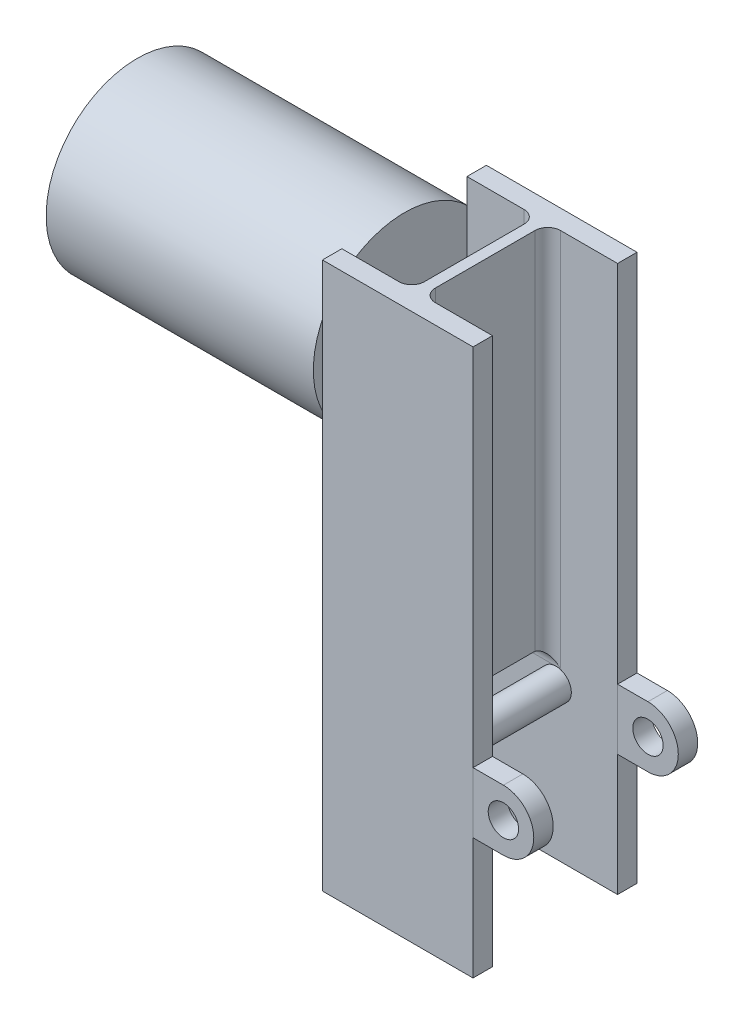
ISO-10303-21;
HEADER;
FILE_DESCRIPTION(('STEP AP214'),'2;1');
FILE_NAME('part.step','',(''),(''),'','','');
FILE_SCHEMA(('AUTOMOTIVE_DESIGN { 1 0 10303 214 1 1 1 1 }'));
ENDSEC;
DATA;
#1=APPLICATION_CONTEXT('core data for automotive mechanical design processes');
#2=APPLICATION_PROTOCOL_DEFINITION('international standard','automotive_design',2000,#1);
#3=PRODUCT_CONTEXT('',#1,'mechanical');
#4=PRODUCT('Part','Part','',(#3));
#5=PRODUCT_RELATED_PRODUCT_CATEGORY('part','',(#4));
#6=PRODUCT_DEFINITION_FORMATION('','',#4);
#7=PRODUCT_DEFINITION_CONTEXT('part definition',#1,'design');
#8=PRODUCT_DEFINITION('design','',#6,#7);
#9=PRODUCT_DEFINITION_SHAPE('','',#8);
#10=(LENGTH_UNIT() NAMED_UNIT(*) SI_UNIT(.MILLI.,.METRE.));
#11=(NAMED_UNIT(*) PLANE_ANGLE_UNIT() SI_UNIT($,.RADIAN.));
#12=(NAMED_UNIT(*) SI_UNIT($,.STERADIAN.) SOLID_ANGLE_UNIT());
#13=UNCERTAINTY_MEASURE_WITH_UNIT(LENGTH_MEASURE(1.E-05),#10,'distance_accuracy_value','');
#14=(GEOMETRIC_REPRESENTATION_CONTEXT(3) GLOBAL_UNCERTAINTY_ASSIGNED_CONTEXT((#13)) GLOBAL_UNIT_ASSIGNED_CONTEXT((#10,
#11,#12)) REPRESENTATION_CONTEXT('',''));
#15=CARTESIAN_POINT('',(0.,0.,0.));
#16=DIRECTION('',(0.,0.,1.));
#17=DIRECTION('',(1.,0.,0.));
#18=AXIS2_PLACEMENT_3D('',#15,#16,#17);
#19=CARTESIAN_POINT('',(-124.,600.,0.));
#20=DIRECTION('',(-1.,0.,0.));
#21=DIRECTION('',(0.,0.,1.));
#22=AXIS2_PLACEMENT_3D('',#19,#20,#21);
#23=PLANE('',#22);
#24=CARTESIAN_POINT('',(-124.,750.,0.));
#25=DIRECTION('',(1.,0.,0.));
#26=DIRECTION('',(0.,0.,-1.));
#27=AXIS2_PLACEMENT_3D('',#24,#25,#26);
#28=CIRCLE('',#27,150.);
#29=CARTESIAN_POINT('',(-124.,750.,-150.));
#30=VERTEX_POINT('',#29);
#31=EDGE_CURVE('E11',#30,#30,#28,.T.);
#32=ORIENTED_EDGE('',*,*,#31,.T.);
#33=EDGE_LOOP('',(#32));
#34=FACE_BOUND('',#33,.T.);
#35=ADVANCED_FACE('F41',(#34),#23,.F.);
#36=CARTESIAN_POINT('',(-124.,750.,0.));
#37=DIRECTION('',(1.,0.,0.));
#38=DIRECTION('',(0.,0.,-1.));
#39=AXIS2_PLACEMENT_3D('',#36,#37,#38);
#40=CYLINDRICAL_SURFACE('',#39,150.);
#41=ORIENTED_EDGE('',*,*,#31,.F.);
#42=EDGE_LOOP('',(#41));
#43=FACE_BOUND('',#42,.T.);
#44=CARTESIAN_POINT('',(-564.,750.,0.));
#45=DIRECTION('',(1.,0.,0.));
#46=DIRECTION('',(0.,0.,-1.));
#47=AXIS2_PLACEMENT_3D('',#44,#45,#46);
#48=CIRCLE('',#47,150.);
#49=CARTESIAN_POINT('',(-564.,750.,-150.));
#50=VERTEX_POINT('',#49);
#51=EDGE_CURVE('E47',#50,#50,#48,.T.);
#52=ORIENTED_EDGE('',*,*,#51,.T.);
#53=EDGE_LOOP('',(#52));
#54=FACE_BOUND('',#53,.T.);
#55=ADVANCED_FACE('F53',(#43,#54),#40,.T.);
#56=CARTESIAN_POINT('',(-564.,600.,0.));
#57=DIRECTION('',(1.,0.,0.));
#58=DIRECTION('',(0.,0.,-1.));
#59=AXIS2_PLACEMENT_3D('',#56,#57,#58);
#60=PLANE('',#59);
#61=ORIENTED_EDGE('',*,*,#51,.F.);
#62=EDGE_LOOP('',(#61));
#63=FACE_BOUND('',#62,.T.);
#64=ADVANCED_FACE('F55',(#63),#60,.F.);
#65=CLOSED_SHELL('',(#35,#55,#64));
#66=MANIFOLD_SOLID_BREP('B2',#65);
#67=CARTESIAN_POINT('',(22.8567729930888,250.,173.710678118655));
#68=DIRECTION('',(0.,0.,-1.));
#69=DIRECTION('',(-1.,0.,0.));
#70=AXIS2_PLACEMENT_3D('',#67,#68,#69);
#71=CYLINDRICAL_SURFACE('',#70,25.);
#72=CARTESIAN_POINT('',(22.8567729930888,250.,-103.));
#73=DIRECTION('',(0.,0.,1.));
#74=DIRECTION('',(1.,0.,0.));
#75=AXIS2_PLACEMENT_3D('',#72,#73,#74);
#76=CIRCLE('',#75,25.);
#77=CARTESIAN_POINT('',(47.8567729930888,250.,-103.));
#78=VERTEX_POINT('',#77);
#79=EDGE_CURVE('E98',#78,#78,#76,.T.);
#80=ORIENTED_EDGE('',*,*,#79,.T.);
#81=EDGE_LOOP('',(#80));
#82=FACE_BOUND('',#81,.T.);
#83=CARTESIAN_POINT('',(22.8567729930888,250.,103.));
#84=DIRECTION('',(0.,0.,1.));
#85=DIRECTION('',(1.,0.,0.));
#86=AXIS2_PLACEMENT_3D('',#83,#84,#85);
#87=CIRCLE('',#86,25.);
#88=CARTESIAN_POINT('',(47.8567729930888,250.,103.));
#89=VERTEX_POINT('',#88);
#90=EDGE_CURVE('E40',#89,#89,#87,.T.);
#91=ORIENTED_EDGE('',*,*,#90,.F.);
#92=EDGE_LOOP('',(#91));
#93=FACE_BOUND('',#92,.T.);
#94=ADVANCED_FACE('F91',(#82,#93),#71,.T.);
#95=CARTESIAN_POINT('',(22.8567729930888,250.,-103.));
#96=DIRECTION('',(0.,0.,1.));
#97=DIRECTION('',(1.,0.,0.));
#98=AXIS2_PLACEMENT_3D('',#95,#96,#97);
#99=PLANE('',#98);
#100=ORIENTED_EDGE('',*,*,#79,.F.);
#101=EDGE_LOOP('',(#100));
#102=FACE_BOUND('',#101,.T.);
#103=ADVANCED_FACE('F106',(#102),#99,.F.);
#104=CARTESIAN_POINT('',(-124.,900.,103.));
#105=DIRECTION('',(0.,0.,1.));
#106=DIRECTION('',(1.,0.,0.));
#107=AXIS2_PLACEMENT_3D('',#104,#105,#106);
#108=PLANE('',#107);
#109=ORIENTED_EDGE('',*,*,#90,.T.);
#110=EDGE_LOOP('',(#109));
#111=FACE_BOUND('',#110,.T.);
#112=ADVANCED_FACE('F93',(#111),#108,.T.);
#113=CLOSED_SHELL('',(#94,#103,#112));
#114=MANIFOLD_SOLID_BREP('B6',#113);
#115=CARTESIAN_POINT('',(124.,200.,38.4213562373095));
#116=DIRECTION('',(0.,-1.,0.));
#117=DIRECTION('',(0.,0.,1.));
#118=AXIS2_PLACEMENT_3D('',#115,#116,#117);
#119=PLANE('',#118);
#120=DIRECTION('',(-1.,0.,0.));
#121=VECTOR('',#120,1.);
#122=CARTESIAN_POINT('',(124.,200.,-103.));
#123=LINE('',#122,#121);
#124=CARTESIAN_POINT('',(174.,200.,-103.));
#125=VERTEX_POINT('',#124);
#126=CARTESIAN_POINT('',(124.,200.,-103.));
#127=VERTEX_POINT('',#126);
#128=EDGE_CURVE('E150',#125,#127,#123,.T.);
#129=ORIENTED_EDGE('',*,*,#128,.T.);
#130=DIRECTION('',(0.,0.,-1.));
#131=VECTOR('',#130,1.);
#132=CARTESIAN_POINT('',(124.,200.,38.4213562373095));
#133=LINE('',#132,#131);
#134=CARTESIAN_POINT('',(124.,200.,-135.));
#135=VERTEX_POINT('',#134);
#136=EDGE_CURVE('E182',#127,#135,#133,.T.);
#137=ORIENTED_EDGE('',*,*,#136,.T.);
#138=DIRECTION('',(1.,0.,0.));
#139=VECTOR('',#138,1.);
#140=CARTESIAN_POINT('',(124.,200.,-135.));
#141=LINE('',#140,#139);
#142=CARTESIAN_POINT('',(174.,200.,-135.));
#143=VERTEX_POINT('',#142);
#144=EDGE_CURVE('E187',#135,#143,#141,.T.);
#145=ORIENTED_EDGE('',*,*,#144,.T.);
#146=DIRECTION('',(0.,0.,-1.));
#147=VECTOR('',#146,1.);
#148=CARTESIAN_POINT('',(174.,200.,38.4213562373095));
#149=LINE('',#148,#147);
#150=EDGE_CURVE('E199',#125,#143,#149,.T.);
#151=ORIENTED_EDGE('',*,*,#150,.F.);
#152=EDGE_LOOP('',(#129,#137,#145,#151));
#153=FACE_BOUND('',#152,.T.);
#154=ADVANCED_FACE('F141',(#153),#119,.T.);
#155=CARTESIAN_POINT('',(174.,250.,38.4213562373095));
#156=DIRECTION('',(0.,0.,-1.));
#157=DIRECTION('',(1.,0.,0.));
#158=AXIS2_PLACEMENT_3D('',#155,#156,#157);
#159=CYLINDRICAL_SURFACE('',#158,50.);
#160=CARTESIAN_POINT('',(174.,250.,-103.));
#161=DIRECTION('',(0.,0.,1.));
#162=DIRECTION('',(1.,0.,0.));
#163=AXIS2_PLACEMENT_3D('',#160,#161,#162);
#164=CIRCLE('',#163,50.);
#165=CARTESIAN_POINT('',(174.,300.,-103.));
#166=VERTEX_POINT('',#165);
#167=EDGE_CURVE('E206',#166,#125,#164,.F.);
#168=ORIENTED_EDGE('',*,*,#167,.T.);
#169=ORIENTED_EDGE('',*,*,#150,.T.);
#170=CARTESIAN_POINT('',(174.,250.,-135.));
#171=DIRECTION('',(0.,0.,1.));
#172=DIRECTION('',(1.,0.,0.));
#173=AXIS2_PLACEMENT_3D('',#170,#171,#172);
#174=CIRCLE('',#173,50.);
#175=CARTESIAN_POINT('',(174.,300.,-135.));
#176=VERTEX_POINT('',#175);
#177=EDGE_CURVE('E193',#143,#176,#174,.T.);
#178=ORIENTED_EDGE('',*,*,#177,.T.);
#179=DIRECTION('',(0.,0.,-1.));
#180=VECTOR('',#179,1.);
#181=CARTESIAN_POINT('',(174.,300.,38.4213562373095));
#182=LINE('',#181,#180);
#183=EDGE_CURVE('E201',#166,#176,#182,.T.);
#184=ORIENTED_EDGE('',*,*,#183,.F.);
#185=EDGE_LOOP('',(#168,#169,#178,#184));
#186=FACE_BOUND('',#185,.T.);
#187=ADVANCED_FACE('F217',(#186),#159,.T.);
#188=CARTESIAN_POINT('',(174.,300.,38.4213562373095));
#189=DIRECTION('',(0.,1.,0.));
#190=DIRECTION('',(0.,0.,-1.));
#191=AXIS2_PLACEMENT_3D('',#188,#189,#190);
#192=PLANE('',#191);
#193=DIRECTION('',(1.,0.,0.));
#194=VECTOR('',#193,1.);
#195=CARTESIAN_POINT('',(174.,300.,-103.));
#196=LINE('',#195,#194);
#197=CARTESIAN_POINT('',(124.,300.,-103.));
#198=VERTEX_POINT('',#197);
#199=EDGE_CURVE('E157',#198,#166,#196,.T.);
#200=ORIENTED_EDGE('',*,*,#199,.T.);
#201=ORIENTED_EDGE('',*,*,#183,.T.);
#202=DIRECTION('',(-1.,0.,0.));
#203=VECTOR('',#202,1.);
#204=CARTESIAN_POINT('',(174.,300.,-135.));
#205=LINE('',#204,#203);
#206=CARTESIAN_POINT('',(124.,300.,-135.));
#207=VERTEX_POINT('',#206);
#208=EDGE_CURVE('E200',#176,#207,#205,.T.);
#209=ORIENTED_EDGE('',*,*,#208,.T.);
#210=DIRECTION('',(0.,0.,-1.));
#211=VECTOR('',#210,1.);
#212=CARTESIAN_POINT('',(124.,300.,38.4213562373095));
#213=LINE('',#212,#211);
#214=EDGE_CURVE('E184',#198,#207,#213,.T.);
#215=ORIENTED_EDGE('',*,*,#214,.F.);
#216=EDGE_LOOP('',(#200,#201,#209,#215));
#217=FACE_BOUND('',#216,.T.);
#218=ADVANCED_FACE('F222',(#217),#192,.T.);
#219=CARTESIAN_POINT('',(124.,300.,38.4213562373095));
#220=DIRECTION('',(-1.,0.,0.));
#221=DIRECTION('',(0.,0.,-1.));
#222=AXIS2_PLACEMENT_3D('',#219,#220,#221);
#223=PLANE('',#222);
#224=DIRECTION('',(0.,1.,0.));
#225=VECTOR('',#224,1.);
#226=CARTESIAN_POINT('',(124.,300.,-103.));
#227=LINE('',#226,#225);
#228=EDGE_CURVE('E211',#127,#198,#227,.T.);
#229=ORIENTED_EDGE('',*,*,#228,.T.);
#230=ORIENTED_EDGE('',*,*,#214,.T.);
#231=DIRECTION('',(0.,-1.,0.));
#232=VECTOR('',#231,1.);
#233=CARTESIAN_POINT('',(124.,300.,-135.));
#234=LINE('',#233,#232);
#235=EDGE_CURVE('E179',#207,#135,#234,.T.);
#236=ORIENTED_EDGE('',*,*,#235,.T.);
#237=ORIENTED_EDGE('',*,*,#136,.F.);
#238=EDGE_LOOP('',(#229,#230,#236,#237));
#239=FACE_BOUND('',#238,.T.);
#240=ADVANCED_FACE('F143',(#239),#223,.T.);
#241=CARTESIAN_POINT('',(174.,250.,-135.));
#242=DIRECTION('',(0.,0.,-1.));
#243=DIRECTION('',(1.,0.,0.));
#244=AXIS2_PLACEMENT_3D('',#241,#242,#243);
#245=PLANE('',#244);
#246=CARTESIAN_POINT('',(174.,250.,-135.));
#247=DIRECTION('',(0.,0.,1.));
#248=DIRECTION('',(1.,0.,0.));
#249=AXIS2_PLACEMENT_3D('',#246,#247,#248);
#250=CIRCLE('',#249,25.);
#251=CARTESIAN_POINT('',(199.,250.,-135.));
#252=VERTEX_POINT('',#251);
#253=EDGE_CURVE('E188',#252,#252,#250,.T.);
#254=ORIENTED_EDGE('',*,*,#253,.T.);
#255=EDGE_LOOP('',(#254));
#256=FACE_BOUND('',#255,.T.);
#257=ORIENTED_EDGE('',*,*,#235,.F.);
#258=ORIENTED_EDGE('',*,*,#208,.F.);
#259=ORIENTED_EDGE('',*,*,#177,.F.);
#260=ORIENTED_EDGE('',*,*,#144,.F.);
#261=EDGE_LOOP('',(#257,#258,#259,#260));
#262=FACE_BOUND('',#261,.T.);
#263=ADVANCED_FACE('F191',(#256,#262),#245,.T.);
#264=CARTESIAN_POINT('',(174.,250.,38.4213562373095));
#265=DIRECTION('',(0.,0.,-1.));
#266=DIRECTION('',(1.,0.,0.));
#267=AXIS2_PLACEMENT_3D('',#264,#265,#266);
#268=CYLINDRICAL_SURFACE('',#267,25.);
#269=CARTESIAN_POINT('',(174.,250.,-103.));
#270=DIRECTION('',(0.,0.,1.));
#271=DIRECTION('',(1.,0.,0.));
#272=AXIS2_PLACEMENT_3D('',#269,#270,#271);
#273=CIRCLE('',#272,25.);
#274=CARTESIAN_POINT('',(199.,250.,-103.));
#275=VERTEX_POINT('',#274);
#276=EDGE_CURVE('E89',#275,#275,#273,.F.);
#277=ORIENTED_EDGE('',*,*,#276,.F.);
#278=EDGE_LOOP('',(#277));
#279=FACE_BOUND('',#278,.T.);
#280=ORIENTED_EDGE('',*,*,#253,.F.);
#281=EDGE_LOOP('',(#280));
#282=FACE_BOUND('',#281,.T.);
#283=ADVANCED_FACE('F257',(#279,#282),#268,.F.);
#284=CARTESIAN_POINT('',(30.,900.,-103.));
#285=DIRECTION('',(0.,0.,-1.));
#286=DIRECTION('',(1.,0.,0.));
#287=AXIS2_PLACEMENT_3D('',#284,#285,#286);
#288=PLANE('',#287);
#289=ORIENTED_EDGE('',*,*,#228,.F.);
#290=ORIENTED_EDGE('',*,*,#128,.F.);
#291=ORIENTED_EDGE('',*,*,#167,.F.);
#292=ORIENTED_EDGE('',*,*,#199,.F.);
#293=EDGE_LOOP('',(#289,#290,#291,#292));
#294=FACE_BOUND('',#293,.T.);
#295=ORIENTED_EDGE('',*,*,#276,.T.);
#296=EDGE_LOOP('',(#295));
#297=FACE_BOUND('',#296,.T.);
#298=ADVANCED_FACE('F220',(#294,#297),#288,.F.);
#299=CLOSED_SHELL('',(#154,#187,#218,#240,#263,#283,#298));
#300=MANIFOLD_SOLID_BREP('B35',#299);
#301=CARTESIAN_POINT('',(124.,200.,-38.4213562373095));
#302=DIRECTION('',(0.,-1.,0.));
#303=DIRECTION('',(0.,0.,-1.));
#304=AXIS2_PLACEMENT_3D('',#301,#302,#303);
#305=PLANE('',#304);
#306=DIRECTION('',(-1.,0.,0.));
#307=VECTOR('',#306,1.);
#308=CARTESIAN_POINT('',(124.,200.,103.));
#309=LINE('',#308,#307);
#310=CARTESIAN_POINT('',(174.,200.,103.));
#311=VERTEX_POINT('',#310);
#312=CARTESIAN_POINT('',(124.,200.,103.));
#313=VERTEX_POINT('',#312);
#314=EDGE_CURVE('E303',#311,#313,#309,.T.);
#315=ORIENTED_EDGE('',*,*,#314,.F.);
#316=DIRECTION('',(0.,0.,1.));
#317=VECTOR('',#316,1.);
#318=CARTESIAN_POINT('',(174.,200.,-38.4213562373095));
#319=LINE('',#318,#317);
#320=CARTESIAN_POINT('',(174.,200.,135.));
#321=VERTEX_POINT('',#320);
#322=EDGE_CURVE('E340',#311,#321,#319,.T.);
#323=ORIENTED_EDGE('',*,*,#322,.T.);
#324=DIRECTION('',(1.,0.,0.));
#325=VECTOR('',#324,1.);
#326=CARTESIAN_POINT('',(124.,200.,135.));
#327=LINE('',#326,#325);
#328=CARTESIAN_POINT('',(124.,200.,135.));
#329=VERTEX_POINT('',#328);
#330=EDGE_CURVE('E343',#329,#321,#327,.T.);
#331=ORIENTED_EDGE('',*,*,#330,.F.);
#332=DIRECTION('',(0.,0.,1.));
#333=VECTOR('',#332,1.);
#334=CARTESIAN_POINT('',(124.,200.,-38.4213562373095));
#335=LINE('',#334,#333);
#336=EDGE_CURVE('E331',#313,#329,#335,.T.);
#337=ORIENTED_EDGE('',*,*,#336,.F.);
#338=EDGE_LOOP('',(#315,#323,#331,#337));
#339=FACE_BOUND('',#338,.T.);
#340=ADVANCED_FACE('F294',(#339),#305,.T.);
#341=CARTESIAN_POINT('',(174.,250.,-38.4213562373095));
#342=DIRECTION('',(0.,0.,1.));
#343=DIRECTION('',(1.,0.,0.));
#344=AXIS2_PLACEMENT_3D('',#341,#342,#343);
#345=CYLINDRICAL_SURFACE('',#344,50.);
#346=CARTESIAN_POINT('',(174.,250.,103.));
#347=DIRECTION('',(0.,0.,1.));
#348=DIRECTION('',(1.,0.,0.));
#349=AXIS2_PLACEMENT_3D('',#346,#347,#348);
#350=CIRCLE('',#349,50.);
#351=CARTESIAN_POINT('',(174.,300.,103.));
#352=VERTEX_POINT('',#351);
#353=EDGE_CURVE('E362',#352,#311,#350,.F.);
#354=ORIENTED_EDGE('',*,*,#353,.F.);
#355=DIRECTION('',(0.,0.,1.));
#356=VECTOR('',#355,1.);
#357=CARTESIAN_POINT('',(174.,300.,-38.4213562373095));
#358=LINE('',#357,#356);
#359=CARTESIAN_POINT('',(174.,300.,135.));
#360=VERTEX_POINT('',#359);
#361=EDGE_CURVE('E363',#352,#360,#358,.T.);
#362=ORIENTED_EDGE('',*,*,#361,.T.);
#363=CARTESIAN_POINT('',(174.,250.,135.));
#364=DIRECTION('',(0.,0.,1.));
#365=DIRECTION('',(1.,0.,0.));
#366=AXIS2_PLACEMENT_3D('',#363,#364,#365);
#367=CIRCLE('',#366,50.);
#368=EDGE_CURVE('E348',#321,#360,#367,.T.);
#369=ORIENTED_EDGE('',*,*,#368,.F.);
#370=ORIENTED_EDGE('',*,*,#322,.F.);
#371=EDGE_LOOP('',(#354,#362,#369,#370));
#372=FACE_BOUND('',#371,.T.);
#373=ADVANCED_FACE('F367',(#372),#345,.T.);
#374=CARTESIAN_POINT('',(174.,300.,-38.4213562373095));
#375=DIRECTION('',(0.,1.,0.));
#376=DIRECTION('',(0.,0.,1.));
#377=AXIS2_PLACEMENT_3D('',#374,#375,#376);
#378=PLANE('',#377);
#379=DIRECTION('',(1.,0.,0.));
#380=VECTOR('',#379,1.);
#381=CARTESIAN_POINT('',(174.,300.,103.));
#382=LINE('',#381,#380);
#383=CARTESIAN_POINT('',(124.,300.,103.));
#384=VERTEX_POINT('',#383);
#385=EDGE_CURVE('E310',#384,#352,#382,.T.);
#386=ORIENTED_EDGE('',*,*,#385,.F.);
#387=DIRECTION('',(0.,0.,1.));
#388=VECTOR('',#387,1.);
#389=CARTESIAN_POINT('',(124.,300.,-38.4213562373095));
#390=LINE('',#389,#388);
#391=CARTESIAN_POINT('',(124.,300.,135.));
#392=VERTEX_POINT('',#391);
#393=EDGE_CURVE('E360',#384,#392,#390,.T.);
#394=ORIENTED_EDGE('',*,*,#393,.T.);
#395=DIRECTION('',(-1.,0.,0.));
#396=VECTOR('',#395,1.);
#397=CARTESIAN_POINT('',(174.,300.,135.));
#398=LINE('',#397,#396);
#399=EDGE_CURVE('E341',#360,#392,#398,.T.);
#400=ORIENTED_EDGE('',*,*,#399,.F.);
#401=ORIENTED_EDGE('',*,*,#361,.F.);
#402=EDGE_LOOP('',(#386,#394,#400,#401));
#403=FACE_BOUND('',#402,.T.);
#404=ADVANCED_FACE('F369',(#403),#378,.T.);
#405=CARTESIAN_POINT('',(124.,300.,-38.4213562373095));
#406=DIRECTION('',(-1.,0.,0.));
#407=DIRECTION('',(0.,0.,1.));
#408=AXIS2_PLACEMENT_3D('',#405,#406,#407);
#409=PLANE('',#408);
#410=DIRECTION('',(0.,1.,0.));
#411=VECTOR('',#410,1.);
#412=CARTESIAN_POINT('',(124.,300.,103.));
#413=LINE('',#412,#411);
#414=EDGE_CURVE('E337',#313,#384,#413,.T.);
#415=ORIENTED_EDGE('',*,*,#414,.F.);
#416=ORIENTED_EDGE('',*,*,#336,.T.);
#417=DIRECTION('',(0.,-1.,0.));
#418=VECTOR('',#417,1.);
#419=CARTESIAN_POINT('',(124.,300.,135.));
#420=LINE('',#419,#418);
#421=EDGE_CURVE('E335',#392,#329,#420,.T.);
#422=ORIENTED_EDGE('',*,*,#421,.F.);
#423=ORIENTED_EDGE('',*,*,#393,.F.);
#424=EDGE_LOOP('',(#415,#416,#422,#423));
#425=FACE_BOUND('',#424,.T.);
#426=ADVANCED_FACE('F296',(#425),#409,.T.);
#427=CARTESIAN_POINT('',(174.,250.,135.));
#428=DIRECTION('',(0.,0.,1.));
#429=DIRECTION('',(1.,0.,0.));
#430=AXIS2_PLACEMENT_3D('',#427,#428,#429);
#431=PLANE('',#430);
#432=CARTESIAN_POINT('',(174.,250.,135.));
#433=DIRECTION('',(0.,0.,1.));
#434=DIRECTION('',(1.,0.,0.));
#435=AXIS2_PLACEMENT_3D('',#432,#433,#434);
#436=CIRCLE('',#435,25.);
#437=CARTESIAN_POINT('',(199.,250.,135.));
#438=VERTEX_POINT('',#437);
#439=EDGE_CURVE('E352',#438,#438,#436,.T.);
#440=ORIENTED_EDGE('',*,*,#439,.F.);
#441=EDGE_LOOP('',(#440));
#442=FACE_BOUND('',#441,.T.);
#443=ORIENTED_EDGE('',*,*,#421,.T.);
#444=ORIENTED_EDGE('',*,*,#330,.T.);
#445=ORIENTED_EDGE('',*,*,#368,.T.);
#446=ORIENTED_EDGE('',*,*,#399,.T.);
#447=EDGE_LOOP('',(#443,#444,#445,#446));
#448=FACE_BOUND('',#447,.T.);
#449=ADVANCED_FACE('F350',(#442,#448),#431,.T.);
#450=CARTESIAN_POINT('',(174.,250.,-38.4213562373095));
#451=DIRECTION('',(0.,0.,1.));
#452=DIRECTION('',(1.,0.,0.));
#453=AXIS2_PLACEMENT_3D('',#450,#451,#452);
#454=CYLINDRICAL_SURFACE('',#453,25.);
#455=CARTESIAN_POINT('',(174.,250.,103.));
#456=DIRECTION('',(0.,0.,1.));
#457=DIRECTION('',(1.,0.,0.));
#458=AXIS2_PLACEMENT_3D('',#455,#456,#457);
#459=CIRCLE('',#458,25.);
#460=CARTESIAN_POINT('',(199.,250.,103.));
#461=VERTEX_POINT('',#460);
#462=EDGE_CURVE('E139',#461,#461,#459,.F.);
#463=ORIENTED_EDGE('',*,*,#462,.T.);
#464=EDGE_LOOP('',(#463));
#465=FACE_BOUND('',#464,.T.);
#466=ORIENTED_EDGE('',*,*,#439,.T.);
#467=EDGE_LOOP('',(#466));
#468=FACE_BOUND('',#467,.T.);
#469=ADVANCED_FACE('F377',(#465,#468),#454,.F.);
#470=CARTESIAN_POINT('',(30.,900.,103.));
#471=DIRECTION('',(0.,0.,1.));
#472=DIRECTION('',(1.,0.,0.));
#473=AXIS2_PLACEMENT_3D('',#470,#471,#472);
#474=PLANE('',#473);
#475=ORIENTED_EDGE('',*,*,#414,.T.);
#476=ORIENTED_EDGE('',*,*,#385,.T.);
#477=ORIENTED_EDGE('',*,*,#353,.T.);
#478=ORIENTED_EDGE('',*,*,#314,.T.);
#479=EDGE_LOOP('',(#475,#476,#477,#478));
#480=FACE_BOUND('',#479,.T.);
#481=ORIENTED_EDGE('',*,*,#462,.F.);
#482=EDGE_LOOP('',(#481));
#483=FACE_BOUND('',#482,.T.);
#484=ADVANCED_FACE('F374',(#480,#483),#474,.F.);
#485=CLOSED_SHELL('',(#340,#373,#404,#426,#449,#469,#484));
#486=MANIFOLD_SOLID_BREP('B83',#485);
#487=CARTESIAN_POINT('',(30.,0.,-82.));
#488=DIRECTION('',(0.,1.,0.));
#489=DIRECTION('',(0.,0.,1.));
#490=AXIS2_PLACEMENT_3D('',#487,#488,#489);
#491=PLANE('',#490);
#492=DIRECTION('',(0.,0.,1.));
#493=VECTOR('',#492,1.);
#494=CARTESIAN_POINT('',(-124.,0.,135.));
#495=LINE('',#494,#493);
#496=CARTESIAN_POINT('',(-124.,0.,103.));
#497=VERTEX_POINT('',#496);
#498=CARTESIAN_POINT('',(-124.,0.,135.));
#499=VERTEX_POINT('',#498);
#500=EDGE_CURVE('E571',#497,#499,#495,.T.);
#501=ORIENTED_EDGE('',*,*,#500,.F.);
#502=DIRECTION('',(-1.,0.,0.));
#503=VECTOR('',#502,1.);
#504=CARTESIAN_POINT('',(30.,0.,103.));
#505=LINE('',#504,#503);
#506=CARTESIAN_POINT('',(124.,0.,103.));
#507=VERTEX_POINT('',#506);
#508=EDGE_CURVE('E578',#507,#497,#505,.T.);
#509=ORIENTED_EDGE('',*,*,#508,.F.);
#510=DIRECTION('',(0.,0.,-1.));
#511=VECTOR('',#510,1.);
#512=CARTESIAN_POINT('',(124.,0.,103.));
#513=LINE('',#512,#511);
#514=CARTESIAN_POINT('',(124.,0.,135.));
#515=VERTEX_POINT('',#514);
#516=EDGE_CURVE('E575',#515,#507,#513,.T.);
#517=ORIENTED_EDGE('',*,*,#516,.F.);
#518=DIRECTION('',(1.,0.,0.));
#519=VECTOR('',#518,1.);
#520=CARTESIAN_POINT('',(124.,0.,135.));
#521=LINE('',#520,#519);
#522=EDGE_CURVE('E573',#499,#515,#521,.T.);
#523=ORIENTED_EDGE('',*,*,#522,.F.);
#524=EDGE_LOOP('',(#501,#509,#517,#523));
#525=FACE_BOUND('',#524,.T.);
#526=ADVANCED_FACE('F438',(#525),#491,.F.);
#527=CARTESIAN_POINT('',(-124.,900.,-135.));
#528=DIRECTION('',(0.,0.,1.));
#529=DIRECTION('',(1.,0.,0.));
#530=AXIS2_PLACEMENT_3D('',#527,#528,#529);
#531=PLANE('',#530);
#532=DIRECTION('',(-1.,0.,0.));
#533=VECTOR('',#532,1.);
#534=CARTESIAN_POINT('',(-124.,0.,-135.));
#535=LINE('',#534,#533);
#536=CARTESIAN_POINT('',(124.,0.,-135.));
#537=VERTEX_POINT('',#536);
#538=CARTESIAN_POINT('',(-124.,0.,-135.));
#539=VERTEX_POINT('',#538);
#540=EDGE_CURVE('E564',#537,#539,#535,.T.);
#541=ORIENTED_EDGE('',*,*,#540,.T.);
#542=DIRECTION('',(0.,-1.,0.));
#543=VECTOR('',#542,1.);
#544=CARTESIAN_POINT('',(-124.,900.,-135.));
#545=LINE('',#544,#543);
#546=CARTESIAN_POINT('',(-124.,900.,-135.));
#547=VERTEX_POINT('',#546);
#548=EDGE_CURVE('E618',#547,#539,#545,.T.);
#549=ORIENTED_EDGE('',*,*,#548,.F.);
#550=DIRECTION('',(-1.,0.,0.));
#551=VECTOR('',#550,1.);
#552=CARTESIAN_POINT('',(-124.,900.,-135.));
#553=LINE('',#552,#551);
#554=CARTESIAN_POINT('',(124.,900.,-135.));
#555=VERTEX_POINT('',#554);
#556=EDGE_CURVE('E584',#555,#547,#553,.T.);
#557=ORIENTED_EDGE('',*,*,#556,.F.);
#558=DIRECTION('',(0.,-1.,0.));
#559=VECTOR('',#558,1.);
#560=CARTESIAN_POINT('',(124.,900.,-135.));
#561=LINE('',#560,#559);
#562=EDGE_CURVE('E560',#555,#537,#561,.T.);
#563=ORIENTED_EDGE('',*,*,#562,.T.);
#564=EDGE_LOOP('',(#541,#549,#557,#563));
#565=FACE_BOUND('',#564,.T.);
#566=ADVANCED_FACE('F440',(#565),#531,.F.);
#567=CARTESIAN_POINT('',(-124.,900.,-103.));
#568=DIRECTION('',(1.,0.,0.));
#569=DIRECTION('',(0.,0.,-1.));
#570=AXIS2_PLACEMENT_3D('',#567,#568,#569);
#571=PLANE('',#570);
#572=DIRECTION('',(0.,0.,1.));
#573=VECTOR('',#572,1.);
#574=CARTESIAN_POINT('',(-124.,0.,-103.));
#575=LINE('',#574,#573);
#576=CARTESIAN_POINT('',(-124.,0.,-103.));
#577=VERTEX_POINT('',#576);
#578=EDGE_CURVE('E567',#539,#577,#575,.T.);
#579=ORIENTED_EDGE('',*,*,#578,.T.);
#580=DIRECTION('',(0.,-1.,0.));
#581=VECTOR('',#580,1.);
#582=CARTESIAN_POINT('',(-124.,900.,-103.));
#583=LINE('',#582,#581);
#584=CARTESIAN_POINT('',(-124.,900.,-103.));
#585=VERTEX_POINT('',#584);
#586=EDGE_CURVE('E616',#585,#577,#583,.T.);
#587=ORIENTED_EDGE('',*,*,#586,.F.);
#588=DIRECTION('',(0.,0.,1.));
#589=VECTOR('',#588,1.);
#590=CARTESIAN_POINT('',(-124.,900.,-103.));
#591=LINE('',#590,#589);
#592=EDGE_CURVE('E497',#547,#585,#591,.T.);
#593=ORIENTED_EDGE('',*,*,#592,.F.);
#594=ORIENTED_EDGE('',*,*,#548,.T.);
#595=EDGE_LOOP('',(#579,#587,#593,#594));
#596=FACE_BOUND('',#595,.T.);
#597=ADVANCED_FACE('F696',(#596),#571,.F.);
#598=CARTESIAN_POINT('',(-30.,900.,-82.));
#599=DIRECTION('',(0.,-1.,0.));
#600=DIRECTION('',(0.,0.,-1.));
#601=AXIS2_PLACEMENT_3D('',#598,#599,#600);
#602=CYLINDRICAL_SURFACE('',#601,21.);
#603=DIRECTION('',(0.,-1.,0.));
#604=VECTOR('',#603,1.);
#605=CARTESIAN_POINT('',(-30.,900.,-103.));
#606=LINE('',#605,#604);
#607=CARTESIAN_POINT('',(-30.,900.,-103.));
#608=VERTEX_POINT('',#607);
#609=CARTESIAN_POINT('',(-30.,275.,-103.));
#610=VERTEX_POINT('',#609);
#611=EDGE_CURVE('E613',#608,#610,#606,.T.);
#612=ORIENTED_EDGE('',*,*,#611,.T.);
#613=CARTESIAN_POINT('',(-8.99999999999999,299.677925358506,-82.));
#614=CARTESIAN_POINT('',(-8.99999191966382,299.635410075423,-82.2623528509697));
#615=CARTESIAN_POINT('',(-9.00491612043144,299.58869566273,-82.5240136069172));
#616=CARTESIAN_POINT('',(-9.02441409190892,299.487035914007,-83.045342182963));
#617=CARTESIAN_POINT('',(-9.0389868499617,299.432091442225,-83.3050102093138));
#618=CARTESIAN_POINT('',(-9.07754616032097,299.314193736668,-83.8215203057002));
#619=CARTESIAN_POINT('',(-9.10152250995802,299.251249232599,-84.0783651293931));
#620=CARTESIAN_POINT('',(-9.15861606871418,299.117529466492,-84.5889647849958));
#621=CARTESIAN_POINT('',(-9.19173347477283,299.046754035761,-84.8427195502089));
#622=CARTESIAN_POINT('',(-9.30367691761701,298.824400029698,-85.5939999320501));
#623=CARTESIAN_POINT('',(-9.39546756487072,298.661679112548,-86.0863996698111));
#624=CARTESIAN_POINT('',(-9.61118688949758,298.30862117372,-87.0539297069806));
#625=CARTESIAN_POINT('',(-9.73512341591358,298.118277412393,-87.5290557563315));
#626=CARTESIAN_POINT('',(-10.0116557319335,297.713332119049,-88.457529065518));
#627=CARTESIAN_POINT('',(-10.1641234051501,297.498840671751,-88.910962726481));
#628=CARTESIAN_POINT('',(-10.4951805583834,297.047437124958,-89.79650596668));
#629=CARTESIAN_POINT('',(-10.6737681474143,296.810526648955,-90.2286170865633));
#630=CARTESIAN_POINT('',(-11.0547376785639,296.316100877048,-91.0714619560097));
#631=CARTESIAN_POINT('',(-11.2571742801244,296.058538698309,-91.4821433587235));
#632=CARTESIAN_POINT('',(-11.6829027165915,295.525539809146,-92.2805008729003));
#633=CARTESIAN_POINT('',(-11.9061994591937,295.250098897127,-92.6681715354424));
#634=CARTESIAN_POINT('',(-12.4889966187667,294.539935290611,-93.6106983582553));
#635=CARTESIAN_POINT('',(-12.8602145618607,294.095178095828,-94.1508187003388));
#636=CARTESIAN_POINT('',(-13.6372171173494,293.176149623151,-95.1785696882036));
#637=CARTESIAN_POINT('',(-14.0430157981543,292.701866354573,-95.6661787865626));
#638=CARTESIAN_POINT('',(-14.8837524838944,291.728277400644,-96.5907543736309));
#639=CARTESIAN_POINT('',(-15.3187404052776,291.228929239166,-97.0276304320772));
#640=CARTESIAN_POINT('',(-16.2120577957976,290.210433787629,-97.851238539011));
#641=CARTESIAN_POINT('',(-16.6703868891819,289.69128681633,-98.2379713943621));
#642=CARTESIAN_POINT('',(-17.7824709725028,288.438124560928,-99.0995944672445));
#643=CARTESIAN_POINT('',(-18.4448268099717,287.696810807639,-99.552845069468));
#644=CARTESIAN_POINT('',(-19.7969478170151,286.190971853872,-100.371793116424));
#645=CARTESIAN_POINT('',(-20.4867249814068,285.426436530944,-100.737451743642));
#646=CARTESIAN_POINT('',(-21.8860426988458,283.880780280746,-101.384466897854));
#647=CARTESIAN_POINT('',(-22.5955749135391,283.099666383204,-101.665858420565));
#648=CARTESIAN_POINT('',(-24.0284775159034,281.525864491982,-102.147255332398));
#649=CARTESIAN_POINT('',(-24.7518424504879,280.733181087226,-102.347292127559));
#650=CARTESIAN_POINT('',(-26.2237864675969,279.122518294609,-102.671740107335));
#651=CARTESIAN_POINT('',(-26.9725684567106,278.30436849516,-102.794369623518));
#652=CARTESIAN_POINT('',(-28.4738695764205,276.665149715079,-102.958056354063));
#653=CARTESIAN_POINT('',(-29.226382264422,275.84408619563,-102.999223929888));
#654=CARTESIAN_POINT('',(-29.9857557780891,275.015541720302,-102.999996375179));
#655=CARTESIAN_POINT('',(-29.9928779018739,275.00777084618,-102.999999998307));
#656=CARTESIAN_POINT('',(-30.,275.,-103.));
#657=B_SPLINE_CURVE_WITH_KNOTS('',3,(#613,#614,#615,#616,#617,#618,#619,#620,#621,#622,#623,
#624,#625,#626,#627,#628,#629,#630,#631,#632,#633,#634,#635,#636,#637,#638,#639,#640,#641,#642,
#643,#644,#645,#646,#647,#648,#649,#650,#651,#652,#653,#654,#655,#656),.UNSPECIFIED.,.F.,.F.,(4,
2,2,2,2,2,2,2,2,2,2,2,2,2,2,2,2,2,2,2,2,4),(0.,0.797228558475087,1.59437345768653,
2.39065585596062,3.18695541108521,4.7646171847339,6.34266453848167,7.91378884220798,
9.48479945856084,11.0594834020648,12.6345387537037,15.0070897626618,17.3806106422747,
19.7582993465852,22.1359497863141,25.4089098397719,28.6833176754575,31.9563637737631,
35.2281451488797,38.5727224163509,41.9127654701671,41.9443882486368),.UNSPECIFIED.);
#658=CARTESIAN_POINT('',(-9.00000000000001,299.677925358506,-82.));
#659=VERTEX_POINT('',#658);
#660=EDGE_CURVE('E681',#610,#659,#657,.F.);
#661=ORIENTED_EDGE('',*,*,#660,.T.);
#662=DIRECTION('',(0.,-1.,0.));
#663=VECTOR('',#662,1.);
#664=CARTESIAN_POINT('',(-8.99999999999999,900.,-82.));
#665=LINE('',#664,#663);
#666=CARTESIAN_POINT('',(-8.99999999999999,900.,-82.));
#667=VERTEX_POINT('',#666);
#668=EDGE_CURVE('E610',#667,#659,#665,.T.);
#669=ORIENTED_EDGE('',*,*,#668,.F.);
#670=CARTESIAN_POINT('',(-30.,900.,-82.));
#671=DIRECTION('',(0.,-1.,0.));
#672=DIRECTION('',(0.,0.,1.));
#673=AXIS2_PLACEMENT_3D('',#670,#671,#672);
#674=CIRCLE('',#673,21.);
#675=EDGE_CURVE('E805',#608,#667,#674,.T.);
#676=ORIENTED_EDGE('',*,*,#675,.F.);
#677=EDGE_LOOP('',(#612,#661,#669,#676));
#678=FACE_BOUND('',#677,.T.);
#679=ADVANCED_FACE('F691',(#678),#602,.F.);
#680=CARTESIAN_POINT('',(-8.99999999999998,900.,82.));
#681=DIRECTION('',(1.,0.,0.));
#682=DIRECTION('',(0.,0.,-1.));
#683=AXIS2_PLACEMENT_3D('',#680,#681,#682);
#684=PLANE('',#683);
#685=DIRECTION('',(0.,0.,1.));
#686=VECTOR('',#685,1.);
#687=CARTESIAN_POINT('',(-8.99999999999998,300.,82.));
#688=LINE('',#687,#686);
#689=CARTESIAN_POINT('',(-9.00000000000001,300.,-78.));
#690=VERTEX_POINT('',#689);
#691=CARTESIAN_POINT('',(-9.00000000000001,300.,78.));
#692=VERTEX_POINT('',#691);
#693=EDGE_CURVE('E688',#690,#692,#688,.T.);
#694=ORIENTED_EDGE('',*,*,#693,.T.);
#695=CARTESIAN_POINT('',(-9.00000000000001,275.,78.));
#696=DIRECTION('',(1.,0.,0.));
#697=DIRECTION('',(0.,0.,-1.));
#698=AXIS2_PLACEMENT_3D('',#695,#696,#697);
#699=CIRCLE('',#698,25.);
#700=CARTESIAN_POINT('',(-8.99999999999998,299.677925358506,82.));
#701=VERTEX_POINT('',#700);
#702=EDGE_CURVE('E568',#692,#701,#699,.T.);
#703=ORIENTED_EDGE('',*,*,#702,.T.);
#704=DIRECTION('',(0.,-1.,0.));
#705=VECTOR('',#704,1.);
#706=CARTESIAN_POINT('',(-8.99999999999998,900.,82.));
#707=LINE('',#706,#705);
#708=CARTESIAN_POINT('',(-8.99999999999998,900.,82.));
#709=VERTEX_POINT('',#708);
#710=EDGE_CURVE('E607',#709,#701,#707,.T.);
#711=ORIENTED_EDGE('',*,*,#710,.F.);
#712=DIRECTION('',(0.,0.,1.));
#713=VECTOR('',#712,1.);
#714=CARTESIAN_POINT('',(-8.99999999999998,900.,82.));
#715=LINE('',#714,#713);
#716=EDGE_CURVE('E803',#667,#709,#715,.T.);
#717=ORIENTED_EDGE('',*,*,#716,.F.);
#718=ORIENTED_EDGE('',*,*,#668,.T.);
#719=CARTESIAN_POINT('',(-9.00000000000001,275.,-78.));
#720=DIRECTION('',(1.,0.,0.));
#721=DIRECTION('',(0.,0.,-1.));
#722=AXIS2_PLACEMENT_3D('',#719,#720,#721);
#723=CIRCLE('',#722,25.);
#724=EDGE_CURVE('E689',#659,#690,#723,.T.);
#725=ORIENTED_EDGE('',*,*,#724,.T.);
#726=EDGE_LOOP('',(#694,#703,#711,#717,#718,#725));
#727=FACE_BOUND('',#726,.T.);
#728=ADVANCED_FACE('F695',(#727),#684,.F.);
#729=CARTESIAN_POINT('',(-30.,900.,82.));
#730=DIRECTION('',(0.,-1.,0.));
#731=DIRECTION('',(0.,0.,-1.));
#732=AXIS2_PLACEMENT_3D('',#729,#730,#731);
#733=CYLINDRICAL_SURFACE('',#732,21.);
#734=ORIENTED_EDGE('',*,*,#710,.T.);
#735=CARTESIAN_POINT('',(-8.99999999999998,299.677925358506,82.));
#736=CARTESIAN_POINT('',(-8.99999191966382,299.635410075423,82.2623528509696));
#737=CARTESIAN_POINT('',(-9.00491612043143,299.58869566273,82.524013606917));
#738=CARTESIAN_POINT('',(-9.02441409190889,299.487035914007,83.0453421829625));
#739=CARTESIAN_POINT('',(-9.03898684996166,299.432091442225,83.3050102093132));
#740=CARTESIAN_POINT('',(-9.07754616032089,299.314193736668,83.8215203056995));
#741=CARTESIAN_POINT('',(-9.10152250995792,299.251249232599,84.0783651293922));
#742=CARTESIAN_POINT('',(-9.15861606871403,299.117529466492,84.5889647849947));
#743=CARTESIAN_POINT('',(-9.19173347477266,299.046754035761,84.8427195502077));
#744=CARTESIAN_POINT('',(-9.30367691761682,298.824400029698,85.593999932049));
#745=CARTESIAN_POINT('',(-9.39546756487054,298.661679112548,86.0863996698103));
#746=CARTESIAN_POINT('',(-9.61118688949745,298.30862117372,87.0539297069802));
#747=CARTESIAN_POINT('',(-9.73512341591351,298.118277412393,87.5290557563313));
#748=CARTESIAN_POINT('',(-10.0116557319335,297.713332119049,88.4575290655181));
#749=CARTESIAN_POINT('',(-10.1641234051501,297.498840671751,88.9109627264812));
#750=CARTESIAN_POINT('',(-10.4951805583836,297.047437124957,89.7965059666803));
#751=CARTESIAN_POINT('',(-10.6737681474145,296.810526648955,90.2286170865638));
#752=CARTESIAN_POINT('',(-11.0547376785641,296.316100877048,91.0714619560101));
#753=CARTESIAN_POINT('',(-11.2571742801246,296.058538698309,91.4821433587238));
#754=CARTESIAN_POINT('',(-11.6829027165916,295.525539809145,92.2805008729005));
#755=CARTESIAN_POINT('',(-11.9061994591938,295.250098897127,92.6681715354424));
#756=CARTESIAN_POINT('',(-12.4889966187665,294.539935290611,93.610698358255));
#757=CARTESIAN_POINT('',(-12.8602145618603,294.095178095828,94.1508187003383));
#758=CARTESIAN_POINT('',(-13.6372171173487,293.176149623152,95.1785696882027));
#759=CARTESIAN_POINT('',(-14.0430157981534,292.701866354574,95.6661787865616));
#760=CARTESIAN_POINT('',(-14.8837524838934,291.728277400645,96.5907543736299));
#761=CARTESIAN_POINT('',(-15.3187404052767,291.228929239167,97.0276304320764));
#762=CARTESIAN_POINT('',(-16.2120577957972,290.210433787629,97.8512385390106));
#763=CARTESIAN_POINT('',(-16.6703868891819,289.691286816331,98.2379713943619));
#764=CARTESIAN_POINT('',(-17.7824709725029,288.438124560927,99.0995944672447));
#765=CARTESIAN_POINT('',(-18.4448268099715,287.696810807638,99.5528450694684));
#766=CARTESIAN_POINT('',(-19.7969478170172,286.190971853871,100.371793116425));
#767=CARTESIAN_POINT('',(-20.4867249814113,285.426436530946,100.737451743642));
#768=CARTESIAN_POINT('',(-21.8860426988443,283.880780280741,101.384466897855));
#769=CARTESIAN_POINT('',(-22.5955749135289,283.099666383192,101.665858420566));
#770=CARTESIAN_POINT('',(-24.0284775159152,281.525864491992,102.147255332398));
#771=CARTESIAN_POINT('',(-24.7518424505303,280.733181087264,102.347292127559));
#772=CARTESIAN_POINT('',(-26.2237864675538,279.122518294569,102.671740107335));
#773=CARTESIAN_POINT('',(-26.9725684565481,278.304368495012,102.794369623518));
#774=CARTESIAN_POINT('',(-28.4738695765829,276.665149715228,102.958056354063));
#775=CARTESIAN_POINT('',(-29.2263822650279,275.844086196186,102.999223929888));
#776=CARTESIAN_POINT('',(-29.9857557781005,275.015541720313,102.999996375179));
#777=CARTESIAN_POINT('',(-29.9928779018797,275.007770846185,102.999999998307));
#778=CARTESIAN_POINT('',(-30.,275.,103.));
#779=B_SPLINE_CURVE_WITH_KNOTS('',3,(#735,#736,#737,#738,#739,#740,#741,#742,#743,#744,#745,
#746,#747,#748,#749,#750,#751,#752,#753,#754,#755,#756,#757,#758,#759,#760,#761,#762,#763,#764,
#765,#766,#767,#768,#769,#770,#771,#772,#773,#774,#775,#776,#777,#778),.UNSPECIFIED.,.F.,.F.,(4,
2,2,2,2,2,2,2,2,2,2,2,2,2,2,2,2,2,2,2,2,4),(0.,0.797228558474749,1.59437345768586,
2.39065585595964,3.18695541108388,4.76461718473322,6.34266453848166,7.91378884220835,
9.48479945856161,11.0594834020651,12.6345387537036,15.0070897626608,17.3806106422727,
19.7582993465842,22.135949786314,25.4089098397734,28.6833176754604,31.9563637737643,
35.2281451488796,38.5727224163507,41.9127654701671,41.9443882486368),.UNSPECIFIED.);
#780=CARTESIAN_POINT('',(-30.,275.,103.));
#781=VERTEX_POINT('',#780);
#782=EDGE_CURVE('E748',#701,#781,#779,.T.);
#783=ORIENTED_EDGE('',*,*,#782,.T.);
#784=DIRECTION('',(0.,-1.,0.));
#785=VECTOR('',#784,1.);
#786=CARTESIAN_POINT('',(-30.,900.,103.));
#787=LINE('',#786,#785);
#788=CARTESIAN_POINT('',(-30.,900.,103.));
#789=VERTEX_POINT('',#788);
#790=EDGE_CURVE('E604',#789,#781,#787,.T.);
#791=ORIENTED_EDGE('',*,*,#790,.F.);
#792=CARTESIAN_POINT('',(-30.,900.,82.));
#793=DIRECTION('',(0.,-1.,0.));
#794=DIRECTION('',(0.,0.,1.));
#795=AXIS2_PLACEMENT_3D('',#792,#793,#794);
#796=CIRCLE('',#795,21.);
#797=EDGE_CURVE('E801',#709,#789,#796,.T.);
#798=ORIENTED_EDGE('',*,*,#797,.F.);
#799=EDGE_LOOP('',(#734,#783,#791,#798));
#800=FACE_BOUND('',#799,.T.);
#801=ADVANCED_FACE('F757',(#800),#733,.F.);
#802=CARTESIAN_POINT('',(-124.,900.,135.));
#803=DIRECTION('',(1.,0.,0.));
#804=DIRECTION('',(0.,0.,-1.));
#805=AXIS2_PLACEMENT_3D('',#802,#803,#804);
#806=PLANE('',#805);
#807=ORIENTED_EDGE('',*,*,#500,.T.);
#808=DIRECTION('',(0.,-1.,0.));
#809=VECTOR('',#808,1.);
#810=CARTESIAN_POINT('',(-124.,900.,135.));
#811=LINE('',#810,#809);
#812=CARTESIAN_POINT('',(-124.,900.,135.));
#813=VERTEX_POINT('',#812);
#814=EDGE_CURVE('E599',#813,#499,#811,.T.);
#815=ORIENTED_EDGE('',*,*,#814,.F.);
#816=DIRECTION('',(0.,0.,1.));
#817=VECTOR('',#816,1.);
#818=CARTESIAN_POINT('',(-124.,900.,135.));
#819=LINE('',#818,#817);
#820=CARTESIAN_POINT('',(-124.,900.,103.));
#821=VERTEX_POINT('',#820);
#822=EDGE_CURVE('E797',#821,#813,#819,.T.);
#823=ORIENTED_EDGE('',*,*,#822,.F.);
#824=DIRECTION('',(0.,-1.,0.));
#825=VECTOR('',#824,1.);
#826=CARTESIAN_POINT('',(-124.,900.,103.));
#827=LINE('',#826,#825);
#828=EDGE_CURVE('E602',#821,#497,#827,.T.);
#829=ORIENTED_EDGE('',*,*,#828,.T.);
#830=EDGE_LOOP('',(#807,#815,#823,#829));
#831=FACE_BOUND('',#830,.T.);
#832=ADVANCED_FACE('F761',(#831),#806,.F.);
#833=CARTESIAN_POINT('',(124.,900.,135.));
#834=DIRECTION('',(0.,0.,-1.));
#835=DIRECTION('',(-1.,0.,0.));
#836=AXIS2_PLACEMENT_3D('',#833,#834,#835);
#837=PLANE('',#836);
#838=ORIENTED_EDGE('',*,*,#522,.T.);
#839=DIRECTION('',(0.,-1.,0.));
#840=VECTOR('',#839,1.);
#841=CARTESIAN_POINT('',(124.,900.,135.));
#842=LINE('',#841,#840);
#843=CARTESIAN_POINT('',(124.,900.,135.));
#844=VERTEX_POINT('',#843);
#845=EDGE_CURVE('E596',#844,#515,#842,.T.);
#846=ORIENTED_EDGE('',*,*,#845,.F.);
#847=DIRECTION('',(1.,0.,0.));
#848=VECTOR('',#847,1.);
#849=CARTESIAN_POINT('',(124.,900.,135.));
#850=LINE('',#849,#848);
#851=EDGE_CURVE('E793',#813,#844,#850,.T.);
#852=ORIENTED_EDGE('',*,*,#851,.F.);
#853=ORIENTED_EDGE('',*,*,#814,.T.);
#854=EDGE_LOOP('',(#838,#846,#852,#853));
#855=FACE_BOUND('',#854,.T.);
#856=ADVANCED_FACE('F765',(#855),#837,.F.);
#857=CARTESIAN_POINT('',(124.,900.,103.));
#858=DIRECTION('',(-1.,0.,0.));
#859=DIRECTION('',(0.,0.,1.));
#860=AXIS2_PLACEMENT_3D('',#857,#858,#859);
#861=PLANE('',#860);
#862=ORIENTED_EDGE('',*,*,#516,.T.);
#863=DIRECTION('',(0.,-1.,0.));
#864=VECTOR('',#863,1.);
#865=CARTESIAN_POINT('',(124.,900.,103.));
#866=LINE('',#865,#864);
#867=CARTESIAN_POINT('',(124.,900.,103.));
#868=VERTEX_POINT('',#867);
#869=EDGE_CURVE('E594',#868,#507,#866,.T.);
#870=ORIENTED_EDGE('',*,*,#869,.F.);
#871=DIRECTION('',(0.,0.,-1.));
#872=VECTOR('',#871,1.);
#873=CARTESIAN_POINT('',(124.,900.,103.));
#874=LINE('',#873,#872);
#875=EDGE_CURVE('E790',#844,#868,#874,.T.);
#876=ORIENTED_EDGE('',*,*,#875,.F.);
#877=ORIENTED_EDGE('',*,*,#845,.T.);
#878=EDGE_LOOP('',(#862,#870,#876,#877));
#879=FACE_BOUND('',#878,.T.);
#880=ADVANCED_FACE('F768',(#879),#861,.F.);
#881=CARTESIAN_POINT('',(30.,900.,103.));
#882=DIRECTION('',(0.,0.,1.));
#883=DIRECTION('',(1.,0.,0.));
#884=AXIS2_PLACEMENT_3D('',#881,#882,#883);
#885=PLANE('',#884);
#886=ORIENTED_EDGE('',*,*,#508,.T.);
#887=ORIENTED_EDGE('',*,*,#828,.F.);
#888=DIRECTION('',(-1.,0.,0.));
#889=VECTOR('',#888,1.);
#890=CARTESIAN_POINT('',(-124.,900.,103.));
#891=LINE('',#890,#889);
#892=EDGE_CURVE('E799',#789,#821,#891,.T.);
#893=ORIENTED_EDGE('',*,*,#892,.F.);
#894=ORIENTED_EDGE('',*,*,#790,.T.);
#895=DIRECTION('',(1.,0.,0.));
#896=VECTOR('',#895,1.);
#897=CARTESIAN_POINT('',(-564.,275.,103.));
#898=LINE('',#897,#896);
#899=CARTESIAN_POINT('',(30.,275.,103.));
#900=VERTEX_POINT('',#899);
#901=EDGE_CURVE('E652',#781,#900,#898,.T.);
#902=ORIENTED_EDGE('',*,*,#901,.T.);
#903=DIRECTION('',(0.,-1.,0.));
#904=VECTOR('',#903,1.);
#905=CARTESIAN_POINT('',(30.,900.,103.));
#906=LINE('',#905,#904);
#907=CARTESIAN_POINT('',(30.,900.,103.));
#908=VERTEX_POINT('',#907);
#909=EDGE_CURVE('E591',#908,#900,#906,.T.);
#910=ORIENTED_EDGE('',*,*,#909,.F.);
#911=DIRECTION('',(-1.,0.,0.));
#912=VECTOR('',#911,1.);
#913=CARTESIAN_POINT('',(30.,900.,103.));
#914=LINE('',#913,#912);
#915=EDGE_CURVE('E787',#868,#908,#914,.T.);
#916=ORIENTED_EDGE('',*,*,#915,.F.);
#917=ORIENTED_EDGE('',*,*,#869,.T.);
#918=EDGE_LOOP('',(#886,#887,#893,#894,#902,#910,#916,#917));
#919=FACE_BOUND('',#918,.T.);
#920=ADVANCED_FACE('F737',(#919),#885,.F.);
#921=CARTESIAN_POINT('',(30.,900.,82.));
#922=DIRECTION('',(0.,-1.,0.));
#923=DIRECTION('',(0.,0.,-1.));
#924=AXIS2_PLACEMENT_3D('',#921,#922,#923);
#925=CYLINDRICAL_SURFACE('',#924,21.);
#926=ORIENTED_EDGE('',*,*,#909,.T.);
#927=CARTESIAN_POINT('',(9.00000000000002,299.677925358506,82.));
#928=CARTESIAN_POINT('',(8.99999191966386,299.635410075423,82.2623528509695));
#929=CARTESIAN_POINT('',(9.00491612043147,299.58869566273,82.5240136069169));
#930=CARTESIAN_POINT('',(9.02441409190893,299.487035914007,83.0453421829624));
#931=CARTESIAN_POINT('',(9.0389868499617,299.432091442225,83.3050102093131));
#932=CARTESIAN_POINT('',(9.07754616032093,299.314193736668,83.8215203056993));
#933=CARTESIAN_POINT('',(9.10152250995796,299.251249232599,84.078365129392));
#934=CARTESIAN_POINT('',(9.15861606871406,299.117529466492,84.5889647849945));
#935=CARTESIAN_POINT('',(9.19173347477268,299.046754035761,84.8427195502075));
#936=CARTESIAN_POINT('',(9.30367691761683,298.824400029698,85.5939999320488));
#937=CARTESIAN_POINT('',(9.39546756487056,298.661679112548,86.0863996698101));
#938=CARTESIAN_POINT('',(9.61118688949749,298.30862117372,87.0539297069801));
#939=CARTESIAN_POINT('',(9.73512341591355,298.118277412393,87.5290557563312));
#940=CARTESIAN_POINT('',(10.0116557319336,297.713332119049,88.4575290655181));
#941=CARTESIAN_POINT('',(10.1641234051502,297.498840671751,88.9109627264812));
#942=CARTESIAN_POINT('',(10.4951805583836,297.047437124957,89.7965059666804));
#943=CARTESIAN_POINT('',(10.6737681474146,296.810526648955,90.2286170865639));
#944=CARTESIAN_POINT('',(11.0547376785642,296.316100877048,91.0714619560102));
#945=CARTESIAN_POINT('',(11.2571742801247,296.058538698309,91.4821433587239));
#946=CARTESIAN_POINT('',(11.6829027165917,295.525539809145,92.2805008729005));
#947=CARTESIAN_POINT('',(11.9061994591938,295.250098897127,92.6681715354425));
#948=CARTESIAN_POINT('',(12.4889966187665,294.539935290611,93.610698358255));
#949=CARTESIAN_POINT('',(12.8602145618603,294.095178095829,94.1508187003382));
#950=CARTESIAN_POINT('',(13.6372171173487,293.176149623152,95.1785696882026));
#951=CARTESIAN_POINT('',(14.0430157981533,292.701866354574,95.6661787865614));
#952=CARTESIAN_POINT('',(14.8837524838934,291.728277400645,96.5907543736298));
#953=CARTESIAN_POINT('',(15.3187404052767,291.228929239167,97.0276304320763));
#954=CARTESIAN_POINT('',(16.2120577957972,290.21043378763,97.8512385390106));
#955=CARTESIAN_POINT('',(16.6703868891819,289.691286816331,98.2379713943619));
#956=CARTESIAN_POINT('',(17.782470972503,288.438124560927,99.0995944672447));
#957=CARTESIAN_POINT('',(18.4448268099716,287.696810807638,99.5528450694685));
#958=CARTESIAN_POINT('',(19.7969478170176,286.190971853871,100.371793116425));
#959=CARTESIAN_POINT('',(20.4867249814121,285.426436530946,100.737451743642));
#960=CARTESIAN_POINT('',(21.8860426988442,283.880780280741,101.384466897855));
#961=CARTESIAN_POINT('',(22.5955749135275,283.09966638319,101.665858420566));
#962=CARTESIAN_POINT('',(24.028477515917,281.525864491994,102.147255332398));
#963=CARTESIAN_POINT('',(24.7518424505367,280.73318108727,102.347292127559));
#964=CARTESIAN_POINT('',(26.2237864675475,279.122518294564,102.671740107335));
#965=CARTESIAN_POINT('',(26.9725684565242,278.30436849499,102.794369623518));
#966=CARTESIAN_POINT('',(28.4738695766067,276.66514971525,102.958056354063));
#967=CARTESIAN_POINT('',(29.226382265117,275.844086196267,102.999223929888));
#968=CARTESIAN_POINT('',(29.9857557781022,275.015541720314,102.999996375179));
#969=CARTESIAN_POINT('',(29.9928779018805,275.007770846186,102.999999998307));
#970=CARTESIAN_POINT('',(30.,275.,103.));
#971=B_SPLINE_CURVE_WITH_KNOTS('',3,(#927,#928,#929,#930,#931,#932,#933,#934,#935,#936,#937,
#938,#939,#940,#941,#942,#943,#944,#945,#946,#947,#948,#949,#950,#951,#952,#953,#954,#955,#956,
#957,#958,#959,#960,#961,#962,#963,#964,#965,#966,#967,#968,#969,#970),.UNSPECIFIED.,.F.,.F.,(4,
2,2,2,2,2,2,2,2,2,2,2,2,2,2,2,2,2,2,2,2,4),(0.,0.797228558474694,1.59437345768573,
2.39065585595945,3.18695541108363,4.76461718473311,6.34266453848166,7.91378884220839,
9.48479945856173,11.0594834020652,12.6345387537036,15.0070897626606,17.3806106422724,
19.758299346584,22.1359497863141,25.4089098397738,28.6833176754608,31.9563637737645,
35.2281451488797,38.5727224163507,41.912765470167,41.9443882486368),.UNSPECIFIED.);
#972=CARTESIAN_POINT('',(9.00000000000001,299.677925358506,82.));
#973=VERTEX_POINT('',#972);
#974=EDGE_CURVE('E743',#900,#973,#971,.F.);
#975=ORIENTED_EDGE('',*,*,#974,.T.);
#976=DIRECTION('',(0.,-1.,0.));
#977=VECTOR('',#976,1.);
#978=CARTESIAN_POINT('',(9.00000000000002,900.,82.));
#979=LINE('',#978,#977);
#980=CARTESIAN_POINT('',(9.00000000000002,900.,82.));
#981=VERTEX_POINT('',#980);
#982=EDGE_CURVE('E588',#981,#973,#979,.T.);
#983=ORIENTED_EDGE('',*,*,#982,.F.);
#984=CARTESIAN_POINT('',(30.,900.,82.));
#985=DIRECTION('',(0.,-1.,0.));
#986=DIRECTION('',(0.,0.,1.));
#987=AXIS2_PLACEMENT_3D('',#984,#985,#986);
#988=CIRCLE('',#987,21.);
#989=EDGE_CURVE('E789',#908,#981,#988,.T.);
#990=ORIENTED_EDGE('',*,*,#989,.F.);
#991=EDGE_LOOP('',(#926,#975,#983,#990));
#992=FACE_BOUND('',#991,.T.);
#993=ADVANCED_FACE('F733',(#992),#925,.F.);
#994=CARTESIAN_POINT('',(9.00000000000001,900.,-82.));
#995=DIRECTION('',(-1.,0.,0.));
#996=DIRECTION('',(0.,0.,1.));
#997=AXIS2_PLACEMENT_3D('',#994,#995,#996);
#998=PLANE('',#997);
#999=ORIENTED_EDGE('',*,*,#982,.T.);
#1000=CARTESIAN_POINT('',(9.00000000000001,275.,78.));
#1001=DIRECTION('',(-1.,0.,0.));
#1002=DIRECTION('',(0.,0.,1.));
#1003=AXIS2_PLACEMENT_3D('',#1000,#1001,#1002);
#1004=CIRCLE('',#1003,25.);
#1005=CARTESIAN_POINT('',(9.00000000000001,300.,78.));
#1006=VERTEX_POINT('',#1005);
#1007=EDGE_CURVE('E292',#973,#1006,#1004,.T.);
#1008=ORIENTED_EDGE('',*,*,#1007,.T.);
#1009=DIRECTION('',(0.,0.,-1.));
#1010=VECTOR('',#1009,1.);
#1011=CARTESIAN_POINT('',(9.00000000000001,300.,-82.));
#1012=LINE('',#1011,#1010);
#1013=CARTESIAN_POINT('',(9.00000000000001,300.,-78.));
#1014=VERTEX_POINT('',#1013);
#1015=EDGE_CURVE('E447',#1006,#1014,#1012,.T.);
#1016=ORIENTED_EDGE('',*,*,#1015,.T.);
#1017=CARTESIAN_POINT('',(9.00000000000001,275.,-78.));
#1018=DIRECTION('',(-1.,0.,0.));
#1019=DIRECTION('',(0.,0.,1.));
#1020=AXIS2_PLACEMENT_3D('',#1017,#1018,#1019);
#1021=CIRCLE('',#1020,25.);
#1022=CARTESIAN_POINT('',(9.00000000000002,299.677925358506,-82.));
#1023=VERTEX_POINT('',#1022);
#1024=EDGE_CURVE('E627',#1014,#1023,#1021,.T.);
#1025=ORIENTED_EDGE('',*,*,#1024,.T.);
#1026=DIRECTION('',(0.,-1.,0.));
#1027=VECTOR('',#1026,1.);
#1028=CARTESIAN_POINT('',(9.00000000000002,900.,-82.));
#1029=LINE('',#1028,#1027);
#1030=CARTESIAN_POINT('',(9.00000000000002,900.,-82.));
#1031=VERTEX_POINT('',#1030);
#1032=EDGE_CURVE('E556',#1031,#1023,#1029,.T.);
#1033=ORIENTED_EDGE('',*,*,#1032,.F.);
#1034=DIRECTION('',(0.,0.,-1.));
#1035=VECTOR('',#1034,1.);
#1036=CARTESIAN_POINT('',(9.00000000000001,900.,-82.));
#1037=LINE('',#1036,#1035);
#1038=EDGE_CURVE('E542',#981,#1031,#1037,.T.);
#1039=ORIENTED_EDGE('',*,*,#1038,.F.);
#1040=EDGE_LOOP('',(#999,#1008,#1016,#1025,#1033,#1039));
#1041=FACE_BOUND('',#1040,.T.);
#1042=ADVANCED_FACE('F624',(#1041),#998,.F.);
#1043=CARTESIAN_POINT('',(30.,900.,-82.));
#1044=DIRECTION('',(0.,-1.,0.));
#1045=DIRECTION('',(0.,0.,-1.));
#1046=AXIS2_PLACEMENT_3D('',#1043,#1044,#1045);
#1047=CYLINDRICAL_SURFACE('',#1046,21.);
#1048=ORIENTED_EDGE('',*,*,#1032,.T.);
#1049=CARTESIAN_POINT('',(9.00000000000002,299.677925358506,-82.));
#1050=CARTESIAN_POINT('',(8.99999191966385,299.635410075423,-82.2623528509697));
#1051=CARTESIAN_POINT('',(9.00491612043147,299.58869566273,-82.5240136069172));
#1052=CARTESIAN_POINT('',(9.02441409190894,299.487035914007,-83.045342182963));
#1053=CARTESIAN_POINT('',(9.03898684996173,299.432091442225,-83.3050102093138));
#1054=CARTESIAN_POINT('',(9.077546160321,299.314193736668,-83.8215203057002));
#1055=CARTESIAN_POINT('',(9.10152250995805,299.251249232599,-84.0783651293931));
#1056=CARTESIAN_POINT('',(9.15861606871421,299.117529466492,-84.5889647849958));
#1057=CARTESIAN_POINT('',(9.19173347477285,299.046754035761,-84.8427195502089));
#1058=CARTESIAN_POINT('',(9.30367691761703,298.824400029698,-85.5939999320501));
#1059=CARTESIAN_POINT('',(9.39546756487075,298.661679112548,-86.0863996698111));
#1060=CARTESIAN_POINT('',(9.6111868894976,298.30862117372,-87.0539297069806));
#1061=CARTESIAN_POINT('',(9.73512341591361,298.118277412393,-87.5290557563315));
#1062=CARTESIAN_POINT('',(10.0116557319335,297.713332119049,-88.457529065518));
#1063=CARTESIAN_POINT('',(10.1641234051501,297.498840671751,-88.910962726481));
#1064=CARTESIAN_POINT('',(10.4951805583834,297.047437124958,-89.79650596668));
#1065=CARTESIAN_POINT('',(10.6737681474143,296.810526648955,-90.2286170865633));
#1066=CARTESIAN_POINT('',(11.0547376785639,296.316100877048,-91.0714619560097));
#1067=CARTESIAN_POINT('',(11.2571742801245,296.058538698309,-91.4821433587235));
#1068=CARTESIAN_POINT('',(11.6829027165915,295.525539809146,-92.2805008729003));
#1069=CARTESIAN_POINT('',(11.9061994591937,295.250098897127,-92.6681715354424));
#1070=CARTESIAN_POINT('',(12.4889966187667,294.539935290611,-93.6106983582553));
#1071=CARTESIAN_POINT('',(12.8602145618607,294.095178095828,-94.1508187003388));
#1072=CARTESIAN_POINT('',(13.6372171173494,293.176149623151,-95.1785696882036));
#1073=CARTESIAN_POINT('',(14.0430157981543,292.701866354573,-95.6661787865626));
#1074=CARTESIAN_POINT('',(14.8837524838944,291.728277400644,-96.5907543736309));
#1075=CARTESIAN_POINT('',(15.3187404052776,291.228929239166,-97.0276304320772));
#1076=CARTESIAN_POINT('',(16.2120577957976,290.210433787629,-97.851238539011));
#1077=CARTESIAN_POINT('',(16.670386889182,289.69128681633,-98.2379713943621));
#1078=CARTESIAN_POINT('',(17.7824709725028,288.438124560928,-99.0995944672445));
#1079=CARTESIAN_POINT('',(18.4448268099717,287.696810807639,-99.552845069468));
#1080=CARTESIAN_POINT('',(19.7969478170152,286.190971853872,-100.371793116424));
#1081=CARTESIAN_POINT('',(20.4867249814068,285.426436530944,-100.737451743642));
#1082=CARTESIAN_POINT('',(21.8860426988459,283.880780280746,-101.384466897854));
#1083=CARTESIAN_POINT('',(22.5955749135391,283.099666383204,-101.665858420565));
#1084=CARTESIAN_POINT('',(24.0284775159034,281.525864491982,-102.147255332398));
#1085=CARTESIAN_POINT('',(24.7518424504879,280.733181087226,-102.347292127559));
#1086=CARTESIAN_POINT('',(26.2237864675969,279.122518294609,-102.671740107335));
#1087=CARTESIAN_POINT('',(26.9725684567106,278.30436849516,-102.794369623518));
#1088=CARTESIAN_POINT('',(28.4738695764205,276.665149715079,-102.958056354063));
#1089=CARTESIAN_POINT('',(29.226382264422,275.84408619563,-102.999223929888));
#1090=CARTESIAN_POINT('',(29.9857557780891,275.015541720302,-102.999996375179));
#1091=CARTESIAN_POINT('',(29.9928779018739,275.00777084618,-102.999999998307));
#1092=CARTESIAN_POINT('',(30.,275.,-103.));
#1093=B_SPLINE_CURVE_WITH_KNOTS('',3,(#1049,#1050,#1051,#1052,#1053,#1054,#1055,#1056,#1057,
#1058,#1059,#1060,#1061,#1062,#1063,#1064,#1065,#1066,#1067,#1068,#1069,#1070,#1071,#1072,#1073,
#1074,#1075,#1076,#1077,#1078,#1079,#1080,#1081,#1082,#1083,#1084,#1085,#1086,#1087,#1088,#1089,
#1090,#1091,#1092),.UNSPECIFIED.,.F.,.F.,(4,2,2,2,2,2,2,2,2,2,2,2,2,2,2,2,2,2,2,2,2,4),(0.,
0.797228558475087,1.59437345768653,2.39065585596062,3.18695541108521,4.7646171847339,
6.34266453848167,7.91378884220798,9.48479945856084,11.0594834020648,12.6345387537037,
15.0070897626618,17.3806106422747,19.7582993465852,22.1359497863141,25.4089098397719,
28.6833176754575,31.9563637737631,35.2281451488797,38.5727224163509,41.9127654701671,
41.9443882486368),.UNSPECIFIED.);
#1094=CARTESIAN_POINT('',(30.,275.,-103.));
#1095=VERTEX_POINT('',#1094);
#1096=EDGE_CURVE('E553',#1023,#1095,#1093,.T.);
#1097=ORIENTED_EDGE('',*,*,#1096,.T.);
#1098=DIRECTION('',(0.,-1.,0.));
#1099=VECTOR('',#1098,1.);
#1100=CARTESIAN_POINT('',(30.,900.,-103.));
#1101=LINE('',#1100,#1099);
#1102=CARTESIAN_POINT('',(30.,900.,-103.));
#1103=VERTEX_POINT('',#1102);
#1104=EDGE_CURVE('E549',#1103,#1095,#1101,.T.);
#1105=ORIENTED_EDGE('',*,*,#1104,.F.);
#1106=CARTESIAN_POINT('',(30.,900.,-82.));
#1107=DIRECTION('',(0.,-1.,0.));
#1108=DIRECTION('',(0.,0.,1.));
#1109=AXIS2_PLACEMENT_3D('',#1106,#1107,#1108);
#1110=CIRCLE('',#1109,21.);
#1111=EDGE_CURVE('E536',#1031,#1103,#1110,.T.);
#1112=ORIENTED_EDGE('',*,*,#1111,.F.);
#1113=EDGE_LOOP('',(#1048,#1097,#1105,#1112));
#1114=FACE_BOUND('',#1113,.T.);
#1115=ADVANCED_FACE('F550',(#1114),#1047,.F.);
#1116=CARTESIAN_POINT('',(124.,900.,-103.));
#1117=DIRECTION('',(0.,0.,-1.));
#1118=DIRECTION('',(-1.,0.,0.));
#1119=AXIS2_PLACEMENT_3D('',#1116,#1117,#1118);
#1120=PLANE('',#1119);
#1121=ORIENTED_EDGE('',*,*,#1104,.T.);
#1122=DIRECTION('',(1.,0.,0.));
#1123=VECTOR('',#1122,1.);
#1124=CARTESIAN_POINT('',(-564.,275.,-103.));
#1125=LINE('',#1124,#1123);
#1126=EDGE_CURVE('E656',#610,#1095,#1125,.T.);
#1127=ORIENTED_EDGE('',*,*,#1126,.F.);
#1128=ORIENTED_EDGE('',*,*,#611,.F.);
#1129=DIRECTION('',(1.,0.,0.));
#1130=VECTOR('',#1129,1.);
#1131=CARTESIAN_POINT('',(-30.,900.,-103.));
#1132=LINE('',#1131,#1130);
#1133=EDGE_CURVE('E807',#585,#608,#1132,.T.);
#1134=ORIENTED_EDGE('',*,*,#1133,.F.);
#1135=ORIENTED_EDGE('',*,*,#586,.T.);
#1136=DIRECTION('',(1.,0.,0.));
#1137=VECTOR('',#1136,1.);
#1138=CARTESIAN_POINT('',(124.,0.,-103.));
#1139=LINE('',#1138,#1137);
#1140=CARTESIAN_POINT('',(124.,0.,-103.));
#1141=VERTEX_POINT('',#1140);
#1142=EDGE_CURVE('E581',#577,#1141,#1139,.T.);
#1143=ORIENTED_EDGE('',*,*,#1142,.T.);
#1144=DIRECTION('',(0.,-1.,0.));
#1145=VECTOR('',#1144,1.);
#1146=CARTESIAN_POINT('',(124.,900.,-103.));
#1147=LINE('',#1146,#1145);
#1148=CARTESIAN_POINT('',(124.,900.,-103.));
#1149=VERTEX_POINT('',#1148);
#1150=EDGE_CURVE('E484',#1149,#1141,#1147,.T.);
#1151=ORIENTED_EDGE('',*,*,#1150,.F.);
#1152=DIRECTION('',(1.,0.,0.));
#1153=VECTOR('',#1152,1.);
#1154=CARTESIAN_POINT('',(124.,900.,-103.));
#1155=LINE('',#1154,#1153);
#1156=EDGE_CURVE('E540',#1103,#1149,#1155,.T.);
#1157=ORIENTED_EDGE('',*,*,#1156,.F.);
#1158=EDGE_LOOP('',(#1121,#1127,#1128,#1134,#1135,#1143,#1151,#1157));
#1159=FACE_BOUND('',#1158,.T.);
#1160=ADVANCED_FACE('F558',(#1159),#1120,.F.);
#1161=CARTESIAN_POINT('',(124.,900.,-135.));
#1162=DIRECTION('',(-1.,0.,0.));
#1163=DIRECTION('',(0.,0.,1.));
#1164=AXIS2_PLACEMENT_3D('',#1161,#1162,#1163);
#1165=PLANE('',#1164);
#1166=DIRECTION('',(0.,0.,-1.));
#1167=VECTOR('',#1166,1.);
#1168=CARTESIAN_POINT('',(124.,0.,-135.));
#1169=LINE('',#1168,#1167);
#1170=EDGE_CURVE('E488',#1141,#537,#1169,.T.);
#1171=ORIENTED_EDGE('',*,*,#1170,.T.);
#1172=ORIENTED_EDGE('',*,*,#562,.F.);
#1173=DIRECTION('',(0.,0.,-1.));
#1174=VECTOR('',#1173,1.);
#1175=CARTESIAN_POINT('',(124.,900.,-135.));
#1176=LINE('',#1175,#1174);
#1177=EDGE_CURVE('E455',#1149,#555,#1176,.T.);
#1178=ORIENTED_EDGE('',*,*,#1177,.F.);
#1179=ORIENTED_EDGE('',*,*,#1150,.T.);
#1180=EDGE_LOOP('',(#1171,#1172,#1178,#1179));
#1181=FACE_BOUND('',#1180,.T.);
#1182=ADVANCED_FACE('F717',(#1181),#1165,.F.);
#1183=CARTESIAN_POINT('',(30.,900.,-82.));
#1184=DIRECTION('',(0.,1.,0.));
#1185=DIRECTION('',(0.,0.,1.));
#1186=AXIS2_PLACEMENT_3D('',#1183,#1184,#1185);
#1187=PLANE('',#1186);
#1188=ORIENTED_EDGE('',*,*,#556,.T.);
#1189=ORIENTED_EDGE('',*,*,#592,.T.);
#1190=ORIENTED_EDGE('',*,*,#1133,.T.);
#1191=ORIENTED_EDGE('',*,*,#675,.T.);
#1192=ORIENTED_EDGE('',*,*,#716,.T.);
#1193=ORIENTED_EDGE('',*,*,#797,.T.);
#1194=ORIENTED_EDGE('',*,*,#892,.T.);
#1195=ORIENTED_EDGE('',*,*,#822,.T.);
#1196=ORIENTED_EDGE('',*,*,#851,.T.);
#1197=ORIENTED_EDGE('',*,*,#875,.T.);
#1198=ORIENTED_EDGE('',*,*,#915,.T.);
#1199=ORIENTED_EDGE('',*,*,#989,.T.);
#1200=ORIENTED_EDGE('',*,*,#1038,.T.);
#1201=ORIENTED_EDGE('',*,*,#1111,.T.);
#1202=ORIENTED_EDGE('',*,*,#1156,.T.);
#1203=ORIENTED_EDGE('',*,*,#1177,.T.);
#1204=EDGE_LOOP('',(#1188,#1189,#1190,#1191,#1192,#1193,#1194,#1195,#1196,#1197,#1198,#1199,
#1200,#1201,#1202,#1203));
#1205=FACE_BOUND('',#1204,.T.);
#1206=ADVANCED_FACE('F538',(#1205),#1187,.T.);
#1207=ORIENTED_EDGE('',*,*,#1142,.F.);
#1208=ORIENTED_EDGE('',*,*,#578,.F.);
#1209=ORIENTED_EDGE('',*,*,#540,.F.);
#1210=ORIENTED_EDGE('',*,*,#1170,.F.);
#1211=EDGE_LOOP('',(#1207,#1208,#1209,#1210));
#1212=FACE_BOUND('',#1211,.T.);
#1213=ADVANCED_FACE('F706',(#1212),#491,.F.);
#1214=CARTESIAN_POINT('',(-564.,275.,78.));
#1215=DIRECTION('',(1.,0.,0.));
#1216=DIRECTION('',(0.,0.,-1.));
#1217=AXIS2_PLACEMENT_3D('',#1214,#1215,#1216);
#1218=CYLINDRICAL_SURFACE('',#1217,25.);
#1219=DIRECTION('',(1.,0.,0.));
#1220=VECTOR('',#1219,1.);
#1221=CARTESIAN_POINT('',(-564.,300.,78.));
#1222=LINE('',#1221,#1220);
#1223=EDGE_CURVE('E639',#692,#1006,#1222,.T.);
#1224=ORIENTED_EDGE('',*,*,#1223,.T.);
#1225=ORIENTED_EDGE('',*,*,#1007,.F.);
#1226=ORIENTED_EDGE('',*,*,#974,.F.);
#1227=ORIENTED_EDGE('',*,*,#901,.F.);
#1228=ORIENTED_EDGE('',*,*,#782,.F.);
#1229=ORIENTED_EDGE('',*,*,#702,.F.);
#1230=EDGE_LOOP('',(#1224,#1225,#1226,#1227,#1228,#1229));
#1231=FACE_BOUND('',#1230,.T.);
#1232=ADVANCED_FACE('F647',(#1231),#1218,.F.);
#1233=CARTESIAN_POINT('',(-564.,300.,78.));
#1234=DIRECTION('',(0.,1.,0.));
#1235=DIRECTION('',(0.,0.,1.));
#1236=AXIS2_PLACEMENT_3D('',#1233,#1234,#1235);
#1237=PLANE('',#1236);
#1238=DIRECTION('',(1.,0.,0.));
#1239=VECTOR('',#1238,1.);
#1240=CARTESIAN_POINT('',(-564.,300.,-78.));
#1241=LINE('',#1240,#1239);
#1242=EDGE_CURVE('E642',#690,#1014,#1241,.T.);
#1243=ORIENTED_EDGE('',*,*,#1242,.T.);
#1244=ORIENTED_EDGE('',*,*,#1015,.F.);
#1245=ORIENTED_EDGE('',*,*,#1223,.F.);
#1246=ORIENTED_EDGE('',*,*,#693,.F.);
#1247=EDGE_LOOP('',(#1243,#1244,#1245,#1246));
#1248=FACE_BOUND('',#1247,.T.);
#1249=ADVANCED_FACE('F636',(#1248),#1237,.F.);
#1250=CARTESIAN_POINT('',(-564.,275.,-78.));
#1251=DIRECTION('',(1.,0.,0.));
#1252=DIRECTION('',(0.,0.,-1.));
#1253=AXIS2_PLACEMENT_3D('',#1250,#1251,#1252);
#1254=CYLINDRICAL_SURFACE('',#1253,25.);
#1255=ORIENTED_EDGE('',*,*,#1126,.T.);
#1256=ORIENTED_EDGE('',*,*,#1096,.F.);
#1257=ORIENTED_EDGE('',*,*,#1024,.F.);
#1258=ORIENTED_EDGE('',*,*,#1242,.F.);
#1259=ORIENTED_EDGE('',*,*,#724,.F.);
#1260=ORIENTED_EDGE('',*,*,#660,.F.);
#1261=EDGE_LOOP('',(#1255,#1256,#1257,#1258,#1259,#1260));
#1262=FACE_BOUND('',#1261,.T.);
#1263=ADVANCED_FACE('F671',(#1262),#1254,.F.);
#1264=CLOSED_SHELL('',(#526,#566,#597,#679,#728,#801,#832,#856,#880,#920,#993,#1042,#1115,#1160,
#1182,#1206,#1213,#1232,#1249,#1263));
#1265=MANIFOLD_SOLID_BREP('B133',#1264);
#1266=ADVANCED_BREP_SHAPE_REPRESENTATION('',(#18,#66,#114,#300,#486,#1265),#14);
#1267=SHAPE_DEFINITION_REPRESENTATION(#9,#1266);
ENDSEC;
END-ISO-10303-21;
